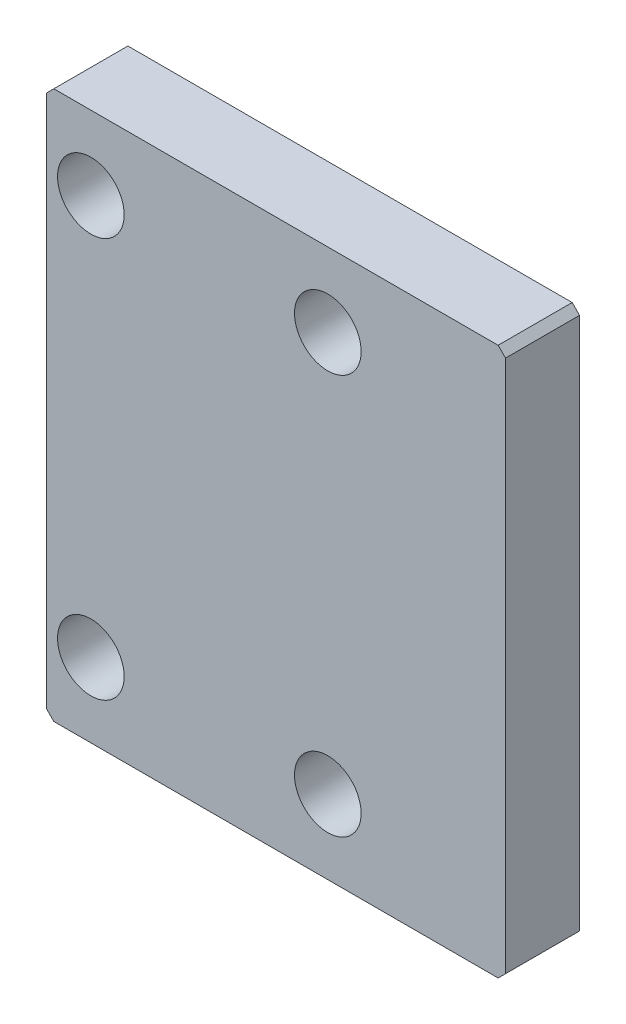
ISO-10303-21;
HEADER;
FILE_DESCRIPTION(('STEP AP214'),'2;1');
FILE_NAME('part.step','',(''),(''),'','','');
FILE_SCHEMA(('AUTOMOTIVE_DESIGN { 1 0 10303 214 1 1 1 1 }'));
ENDSEC;
DATA;
#1=APPLICATION_CONTEXT('core data for automotive mechanical design processes');
#2=APPLICATION_PROTOCOL_DEFINITION('international standard','automotive_design',2000,#1);
#3=PRODUCT_CONTEXT('',#1,'mechanical');
#4=PRODUCT('Part','Part','',(#3));
#5=PRODUCT_RELATED_PRODUCT_CATEGORY('part','',(#4));
#6=PRODUCT_DEFINITION_FORMATION('','',#4);
#7=PRODUCT_DEFINITION_CONTEXT('part definition',#1,'design');
#8=PRODUCT_DEFINITION('design','',#6,#7);
#9=PRODUCT_DEFINITION_SHAPE('','',#8);
#10=(LENGTH_UNIT() NAMED_UNIT(*) SI_UNIT(.MILLI.,.METRE.));
#11=(NAMED_UNIT(*) PLANE_ANGLE_UNIT() SI_UNIT($,.RADIAN.));
#12=(NAMED_UNIT(*) SI_UNIT($,.STERADIAN.) SOLID_ANGLE_UNIT());
#13=UNCERTAINTY_MEASURE_WITH_UNIT(LENGTH_MEASURE(1.E-05),#10,'distance_accuracy_value','');
#14=(GEOMETRIC_REPRESENTATION_CONTEXT(3) GLOBAL_UNCERTAINTY_ASSIGNED_CONTEXT((#13)) GLOBAL_UNIT_ASSIGNED_CONTEXT((#10,
#11,#12)) REPRESENTATION_CONTEXT('',''));
#15=CARTESIAN_POINT('',(0.,0.,0.));
#16=DIRECTION('',(0.,0.,1.));
#17=DIRECTION('',(1.,0.,0.));
#18=AXIS2_PLACEMENT_3D('',#15,#16,#17);
#19=CARTESIAN_POINT('',(-412.720096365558,-1.64,5.));
#20=DIRECTION('',(1.,0.,0.));
#21=DIRECTION('',(0.,0.,-1.));
#22=AXIS2_PLACEMENT_3D('',#19,#20,#21);
#23=PLANE('',#22);
#24=DIRECTION('',(0.,-1.,0.));
#25=VECTOR('',#24,1.);
#26=CARTESIAN_POINT('',(-412.720096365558,-1.64,5.));
#27=LINE('',#26,#25);
#28=CARTESIAN_POINT('',(-412.720096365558,34.86,5.));
#29=VERTEX_POINT('',#28);
#30=CARTESIAN_POINT('',(-412.720096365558,-1.13999999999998,5.));
#31=VERTEX_POINT('',#30);
#32=EDGE_CURVE('E101',#29,#31,#27,.T.);
#33=ORIENTED_EDGE('',*,*,#32,.F.);
#34=DIRECTION('',(0.,0.,-1.));
#35=VECTOR('',#34,1.);
#36=CARTESIAN_POINT('',(-412.720096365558,34.86,5.));
#37=LINE('',#36,#35);
#38=CARTESIAN_POINT('',(-412.720096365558,34.86,0.));
#39=VERTEX_POINT('',#38);
#40=EDGE_CURVE('E86',#29,#39,#37,.T.);
#41=ORIENTED_EDGE('',*,*,#40,.T.);
#42=DIRECTION('',(0.,-1.,0.));
#43=VECTOR('',#42,1.);
#44=CARTESIAN_POINT('',(-412.720096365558,-1.64,0.));
#45=LINE('',#44,#43);
#46=CARTESIAN_POINT('',(-412.720096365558,-1.13999999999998,0.));
#47=VERTEX_POINT('',#46);
#48=EDGE_CURVE('E98',#39,#47,#45,.T.);
#49=ORIENTED_EDGE('',*,*,#48,.T.);
#50=DIRECTION('',(0.,0.,1.));
#51=VECTOR('',#50,1.);
#52=CARTESIAN_POINT('',(-412.720096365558,-1.13999999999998,5.));
#53=LINE('',#52,#51);
#54=EDGE_CURVE('E103',#47,#31,#53,.T.);
#55=ORIENTED_EDGE('',*,*,#54,.T.);
#56=EDGE_LOOP('',(#33,#41,#49,#55));
#57=FACE_BOUND('',#56,.T.);
#58=ADVANCED_FACE('F16',(#57),#23,.F.);
#59=CARTESIAN_POINT('',(-412.720096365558,-1.64,5.));
#60=DIRECTION('',(0.,1.,0.));
#61=DIRECTION('',(0.,0.,1.));
#62=AXIS2_PLACEMENT_3D('',#59,#60,#61);
#63=PLANE('',#62);
#64=DIRECTION('',(1.,0.,0.));
#65=VECTOR('',#64,1.);
#66=CARTESIAN_POINT('',(-412.720096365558,-1.64,5.));
#67=LINE('',#66,#65);
#68=CARTESIAN_POINT('',(-412.220096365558,-1.64,5.));
#69=VERTEX_POINT('',#68);
#70=CARTESIAN_POINT('',(-382.220096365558,-1.64,5.));
#71=VERTEX_POINT('',#70);
#72=EDGE_CURVE('E147',#69,#71,#67,.T.);
#73=ORIENTED_EDGE('',*,*,#72,.F.);
#74=DIRECTION('',(0.,0.,-1.));
#75=VECTOR('',#74,1.);
#76=CARTESIAN_POINT('',(-412.220096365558,-1.64,5.));
#77=LINE('',#76,#75);
#78=CARTESIAN_POINT('',(-412.220096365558,-1.64,0.));
#79=VERTEX_POINT('',#78);
#80=EDGE_CURVE('E140',#69,#79,#77,.T.);
#81=ORIENTED_EDGE('',*,*,#80,.T.);
#82=DIRECTION('',(1.,0.,0.));
#83=VECTOR('',#82,1.);
#84=CARTESIAN_POINT('',(-412.720096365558,-1.64,0.));
#85=LINE('',#84,#83);
#86=CARTESIAN_POINT('',(-382.220096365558,-1.64,0.));
#87=VERTEX_POINT('',#86);
#88=EDGE_CURVE('E107',#79,#87,#85,.T.);
#89=ORIENTED_EDGE('',*,*,#88,.T.);
#90=DIRECTION('',(0.,0.,1.));
#91=VECTOR('',#90,1.);
#92=CARTESIAN_POINT('',(-382.220096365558,-1.64,5.));
#93=LINE('',#92,#91);
#94=EDGE_CURVE('E138',#87,#71,#93,.T.);
#95=ORIENTED_EDGE('',*,*,#94,.T.);
#96=EDGE_LOOP('',(#73,#81,#89,#95));
#97=FACE_BOUND('',#96,.T.);
#98=ADVANCED_FACE('F145',(#97),#63,.F.);
#99=CARTESIAN_POINT('',(-381.720096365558,-1.64,5.));
#100=DIRECTION('',(-1.,0.,0.));
#101=DIRECTION('',(0.,0.,1.));
#102=AXIS2_PLACEMENT_3D('',#99,#100,#101);
#103=PLANE('',#102);
#104=DIRECTION('',(0.,1.,0.));
#105=VECTOR('',#104,1.);
#106=CARTESIAN_POINT('',(-381.720096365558,-1.64,5.));
#107=LINE('',#106,#105);
#108=CARTESIAN_POINT('',(-381.720096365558,-1.14000000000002,5.));
#109=VERTEX_POINT('',#108);
#110=CARTESIAN_POINT('',(-381.720096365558,34.86,5.));
#111=VERTEX_POINT('',#110);
#112=EDGE_CURVE('E155',#109,#111,#107,.T.);
#113=ORIENTED_EDGE('',*,*,#112,.F.);
#114=DIRECTION('',(0.,0.,-1.));
#115=VECTOR('',#114,1.);
#116=CARTESIAN_POINT('',(-381.720096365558,-1.14000000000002,5.));
#117=LINE('',#116,#115);
#118=CARTESIAN_POINT('',(-381.720096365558,-1.14,0.));
#119=VERTEX_POINT('',#118);
#120=EDGE_CURVE('E11',#109,#119,#117,.T.);
#121=ORIENTED_EDGE('',*,*,#120,.T.);
#122=DIRECTION('',(0.,1.,0.));
#123=VECTOR('',#122,1.);
#124=CARTESIAN_POINT('',(-381.720096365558,-1.64,0.));
#125=LINE('',#124,#123);
#126=CARTESIAN_POINT('',(-381.720096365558,34.86,0.));
#127=VERTEX_POINT('',#126);
#128=EDGE_CURVE('E111',#119,#127,#125,.T.);
#129=ORIENTED_EDGE('',*,*,#128,.T.);
#130=DIRECTION('',(0.,0.,1.));
#131=VECTOR('',#130,1.);
#132=CARTESIAN_POINT('',(-381.720096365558,34.86,5.));
#133=LINE('',#132,#131);
#134=EDGE_CURVE('E24',#127,#111,#133,.T.);
#135=ORIENTED_EDGE('',*,*,#134,.T.);
#136=EDGE_LOOP('',(#113,#121,#129,#135));
#137=FACE_BOUND('',#136,.T.);
#138=ADVANCED_FACE('F154',(#137),#103,.F.);
#139=CARTESIAN_POINT('',(-412.720096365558,35.36,5.));
#140=DIRECTION('',(0.,-1.,0.));
#141=DIRECTION('',(0.,0.,-1.));
#142=AXIS2_PLACEMENT_3D('',#139,#140,#141);
#143=PLANE('',#142);
#144=DIRECTION('',(-1.,0.,0.));
#145=VECTOR('',#144,1.);
#146=CARTESIAN_POINT('',(-412.720096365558,35.36,0.));
#147=LINE('',#146,#145);
#148=CARTESIAN_POINT('',(-382.220096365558,35.36,0.));
#149=VERTEX_POINT('',#148);
#150=CARTESIAN_POINT('',(-412.220096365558,35.36,0.));
#151=VERTEX_POINT('',#150);
#152=EDGE_CURVE('E121',#149,#151,#147,.T.);
#153=ORIENTED_EDGE('',*,*,#152,.T.);
#154=DIRECTION('',(0.,0.,1.));
#155=VECTOR('',#154,1.);
#156=CARTESIAN_POINT('',(-412.220096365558,35.36,5.));
#157=LINE('',#156,#155);
#158=CARTESIAN_POINT('',(-412.220096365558,35.36,5.));
#159=VERTEX_POINT('',#158);
#160=EDGE_CURVE('E87',#151,#159,#157,.T.);
#161=ORIENTED_EDGE('',*,*,#160,.T.);
#162=DIRECTION('',(-1.,0.,0.));
#163=VECTOR('',#162,1.);
#164=CARTESIAN_POINT('',(-412.720096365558,35.36,5.));
#165=LINE('',#164,#163);
#166=CARTESIAN_POINT('',(-382.220096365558,35.36,5.));
#167=VERTEX_POINT('',#166);
#168=EDGE_CURVE('E117',#167,#159,#165,.T.);
#169=ORIENTED_EDGE('',*,*,#168,.F.);
#170=DIRECTION('',(0.,0.,-1.));
#171=VECTOR('',#170,1.);
#172=CARTESIAN_POINT('',(-382.220096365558,35.36,5.));
#173=LINE('',#172,#171);
#174=EDGE_CURVE('E92',#167,#149,#173,.T.);
#175=ORIENTED_EDGE('',*,*,#174,.T.);
#176=EDGE_LOOP('',(#153,#161,#169,#175));
#177=FACE_BOUND('',#176,.T.);
#178=ADVANCED_FACE('F187',(#177),#143,.F.);
#179=CARTESIAN_POINT('',(0.,0.,5.));
#180=DIRECTION('',(0.,0.,-1.));
#181=DIRECTION('',(-1.,0.,0.));
#182=AXIS2_PLACEMENT_3D('',#179,#180,#181);
#183=PLANE('',#182);
#184=CARTESIAN_POINT('',(-393.720096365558,3.36,5.));
#185=DIRECTION('',(0.,0.,1.));
#186=DIRECTION('',(1.,0.,0.));
#187=AXIS2_PLACEMENT_3D('',#184,#185,#186);
#188=CIRCLE('',#187,2.24999999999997);
#189=CARTESIAN_POINT('',(-391.470096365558,3.36,5.));
#190=VERTEX_POINT('',#189);
#191=EDGE_CURVE('E178',#190,#190,#188,.T.);
#192=ORIENTED_EDGE('',*,*,#191,.F.);
#193=EDGE_LOOP('',(#192));
#194=FACE_BOUND('',#193,.T.);
#195=CARTESIAN_POINT('',(-393.720096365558,30.36,5.));
#196=DIRECTION('',(0.,0.,1.));
#197=DIRECTION('',(1.,0.,0.));
#198=AXIS2_PLACEMENT_3D('',#195,#196,#197);
#199=CIRCLE('',#198,2.24999999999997);
#200=CARTESIAN_POINT('',(-391.470096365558,30.36,5.));
#201=VERTEX_POINT('',#200);
#202=EDGE_CURVE('E172',#201,#201,#199,.T.);
#203=ORIENTED_EDGE('',*,*,#202,.F.);
#204=EDGE_LOOP('',(#203));
#205=FACE_BOUND('',#204,.T.);
#206=CARTESIAN_POINT('',(-409.720096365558,30.36,5.));
#207=DIRECTION('',(0.,0.,1.));
#208=DIRECTION('',(1.,0.,0.));
#209=AXIS2_PLACEMENT_3D('',#206,#207,#208);
#210=CIRCLE('',#209,2.24999999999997);
#211=CARTESIAN_POINT('',(-407.470096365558,30.36,5.));
#212=VERTEX_POINT('',#211);
#213=EDGE_CURVE('E166',#212,#212,#210,.T.);
#214=ORIENTED_EDGE('',*,*,#213,.F.);
#215=EDGE_LOOP('',(#214));
#216=FACE_BOUND('',#215,.T.);
#217=CARTESIAN_POINT('',(-409.720096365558,3.36,5.));
#218=DIRECTION('',(0.,0.,1.));
#219=DIRECTION('',(1.,0.,0.));
#220=AXIS2_PLACEMENT_3D('',#217,#218,#219);
#221=CIRCLE('',#220,2.24999999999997);
#222=CARTESIAN_POINT('',(-407.470096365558,3.36,5.));
#223=VERTEX_POINT('',#222);
#224=EDGE_CURVE('E114',#223,#223,#221,.T.);
#225=ORIENTED_EDGE('',*,*,#224,.F.);
#226=EDGE_LOOP('',(#225));
#227=FACE_BOUND('',#226,.T.);
#228=ORIENTED_EDGE('',*,*,#168,.T.);
#229=DIRECTION('',(0.707106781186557,0.707106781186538,0.));
#230=VECTOR('',#229,1.);
#231=CARTESIAN_POINT('',(-412.720096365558,34.86,5.));
#232=LINE('',#231,#230);
#233=EDGE_CURVE('E136',#159,#29,#232,.F.);
#234=ORIENTED_EDGE('',*,*,#233,.T.);
#235=ORIENTED_EDGE('',*,*,#32,.T.);
#236=DIRECTION('',(-0.707106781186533,0.707106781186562,0.));
#237=VECTOR('',#236,1.);
#238=CARTESIAN_POINT('',(-412.220096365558,-1.64,5.));
#239=LINE('',#238,#237);
#240=EDGE_CURVE('E134',#31,#69,#239,.F.);
#241=ORIENTED_EDGE('',*,*,#240,.T.);
#242=ORIENTED_EDGE('',*,*,#72,.T.);
#243=DIRECTION('',(-0.707106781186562,-0.707106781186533,0.));
#244=VECTOR('',#243,1.);
#245=CARTESIAN_POINT('',(-381.720096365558,-1.14000000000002,5.));
#246=LINE('',#245,#244);
#247=EDGE_CURVE('E37',#71,#109,#246,.F.);
#248=ORIENTED_EDGE('',*,*,#247,.T.);
#249=ORIENTED_EDGE('',*,*,#112,.T.);
#250=DIRECTION('',(0.707106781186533,-0.707106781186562,0.));
#251=VECTOR('',#250,1.);
#252=CARTESIAN_POINT('',(-382.220096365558,35.36,5.));
#253=LINE('',#252,#251);
#254=EDGE_CURVE('E131',#111,#167,#253,.F.);
#255=ORIENTED_EDGE('',*,*,#254,.T.);
#256=EDGE_LOOP('',(#228,#234,#235,#241,#242,#248,#249,#255));
#257=FACE_BOUND('',#256,.T.);
#258=ADVANCED_FACE('F184',(#194,#205,#216,#227,#257),#183,.F.);
#259=CARTESIAN_POINT('',(0.,0.,0.));
#260=DIRECTION('',(0.,0.,-1.));
#261=DIRECTION('',(-1.,0.,0.));
#262=AXIS2_PLACEMENT_3D('',#259,#260,#261);
#263=PLANE('',#262);
#264=CARTESIAN_POINT('',(-393.720096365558,3.36,0.));
#265=DIRECTION('',(0.,0.,1.));
#266=DIRECTION('',(1.,0.,0.));
#267=AXIS2_PLACEMENT_3D('',#264,#265,#266);
#268=CIRCLE('',#267,2.24999999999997);
#269=CARTESIAN_POINT('',(-391.470096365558,3.36,0.));
#270=VERTEX_POINT('',#269);
#271=EDGE_CURVE('E175',#270,#270,#268,.T.);
#272=ORIENTED_EDGE('',*,*,#271,.T.);
#273=EDGE_LOOP('',(#272));
#274=FACE_BOUND('',#273,.T.);
#275=CARTESIAN_POINT('',(-393.720096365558,30.36,0.));
#276=DIRECTION('',(0.,0.,1.));
#277=DIRECTION('',(1.,0.,0.));
#278=AXIS2_PLACEMENT_3D('',#275,#276,#277);
#279=CIRCLE('',#278,2.24999999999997);
#280=CARTESIAN_POINT('',(-391.470096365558,30.36,0.));
#281=VERTEX_POINT('',#280);
#282=EDGE_CURVE('E169',#281,#281,#279,.T.);
#283=ORIENTED_EDGE('',*,*,#282,.T.);
#284=EDGE_LOOP('',(#283));
#285=FACE_BOUND('',#284,.T.);
#286=CARTESIAN_POINT('',(-409.720096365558,30.36,0.));
#287=DIRECTION('',(0.,0.,1.));
#288=DIRECTION('',(1.,0.,0.));
#289=AXIS2_PLACEMENT_3D('',#286,#287,#288);
#290=CIRCLE('',#289,2.24999999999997);
#291=CARTESIAN_POINT('',(-407.470096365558,30.36,0.));
#292=VERTEX_POINT('',#291);
#293=EDGE_CURVE('E163',#292,#292,#290,.T.);
#294=ORIENTED_EDGE('',*,*,#293,.T.);
#295=EDGE_LOOP('',(#294));
#296=FACE_BOUND('',#295,.T.);
#297=CARTESIAN_POINT('',(-409.720096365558,3.36,0.));
#298=DIRECTION('',(0.,0.,1.));
#299=DIRECTION('',(1.,0.,0.));
#300=AXIS2_PLACEMENT_3D('',#297,#298,#299);
#301=CIRCLE('',#300,2.24999999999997);
#302=CARTESIAN_POINT('',(-407.470096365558,3.36,0.));
#303=VERTEX_POINT('',#302);
#304=EDGE_CURVE('E108',#303,#303,#301,.T.);
#305=ORIENTED_EDGE('',*,*,#304,.T.);
#306=EDGE_LOOP('',(#305));
#307=FACE_BOUND('',#306,.T.);
#308=ORIENTED_EDGE('',*,*,#48,.F.);
#309=DIRECTION('',(-0.707106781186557,-0.707106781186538,0.));
#310=VECTOR('',#309,1.);
#311=CARTESIAN_POINT('',(-223.790048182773,223.79004818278,0.));
#312=LINE('',#311,#310);
#313=EDGE_CURVE('E82',#39,#151,#312,.F.);
#314=ORIENTED_EDGE('',*,*,#313,.T.);
#315=ORIENTED_EDGE('',*,*,#152,.F.);
#316=DIRECTION('',(-0.707106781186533,0.707106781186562,0.));
#317=VECTOR('',#316,1.);
#318=CARTESIAN_POINT('',(-173.430048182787,-173.43004818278,0.));
#319=LINE('',#318,#317);
#320=EDGE_CURVE('E102',#149,#127,#319,.F.);
#321=ORIENTED_EDGE('',*,*,#320,.T.);
#322=ORIENTED_EDGE('',*,*,#128,.F.);
#323=DIRECTION('',(0.707106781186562,0.707106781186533,0.));
#324=VECTOR('',#323,1.);
#325=CARTESIAN_POINT('',(-190.290048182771,190.290048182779,0.));
#326=LINE('',#325,#324);
#327=EDGE_CURVE('E125',#119,#87,#326,.F.);
#328=ORIENTED_EDGE('',*,*,#327,.T.);
#329=ORIENTED_EDGE('',*,*,#88,.F.);
#330=DIRECTION('',(0.707106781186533,-0.707106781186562,0.));
#331=VECTOR('',#330,1.);
#332=CARTESIAN_POINT('',(-206.930048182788,-206.930048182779,0.));
#333=LINE('',#332,#331);
#334=EDGE_CURVE('E93',#79,#47,#333,.F.);
#335=ORIENTED_EDGE('',*,*,#334,.T.);
#336=EDGE_LOOP('',(#308,#314,#315,#321,#322,#328,#329,#335));
#337=FACE_BOUND('',#336,.T.);
#338=ADVANCED_FACE('F105',(#274,#285,#296,#307,#337),#263,.T.);
#339=CARTESIAN_POINT('',(-409.720096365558,3.36,5.));
#340=DIRECTION('',(0.,0.,1.));
#341=DIRECTION('',(1.,0.,0.));
#342=AXIS2_PLACEMENT_3D('',#339,#340,#341);
#343=CYLINDRICAL_SURFACE('',#342,2.24999999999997);
#344=ORIENTED_EDGE('',*,*,#304,.F.);
#345=EDGE_LOOP('',(#344));
#346=FACE_BOUND('',#345,.T.);
#347=ORIENTED_EDGE('',*,*,#224,.T.);
#348=EDGE_LOOP('',(#347));
#349=FACE_BOUND('',#348,.T.);
#350=ADVANCED_FACE('F263',(#346,#349),#343,.F.);
#351=CARTESIAN_POINT('',(-409.720096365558,30.36,5.));
#352=DIRECTION('',(0.,0.,1.));
#353=DIRECTION('',(1.,0.,0.));
#354=AXIS2_PLACEMENT_3D('',#351,#352,#353);
#355=CYLINDRICAL_SURFACE('',#354,2.24999999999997);
#356=ORIENTED_EDGE('',*,*,#293,.F.);
#357=EDGE_LOOP('',(#356));
#358=FACE_BOUND('',#357,.T.);
#359=ORIENTED_EDGE('',*,*,#213,.T.);
#360=EDGE_LOOP('',(#359));
#361=FACE_BOUND('',#360,.T.);
#362=ADVANCED_FACE('F255',(#358,#361),#355,.F.);
#363=CARTESIAN_POINT('',(-393.720096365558,30.36,5.));
#364=DIRECTION('',(0.,0.,1.));
#365=DIRECTION('',(1.,0.,0.));
#366=AXIS2_PLACEMENT_3D('',#363,#364,#365);
#367=CYLINDRICAL_SURFACE('',#366,2.24999999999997);
#368=ORIENTED_EDGE('',*,*,#282,.F.);
#369=EDGE_LOOP('',(#368));
#370=FACE_BOUND('',#369,.T.);
#371=ORIENTED_EDGE('',*,*,#202,.T.);
#372=EDGE_LOOP('',(#371));
#373=FACE_BOUND('',#372,.T.);
#374=ADVANCED_FACE('F247',(#370,#373),#367,.F.);
#375=CARTESIAN_POINT('',(-393.720096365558,3.36,5.));
#376=DIRECTION('',(0.,0.,1.));
#377=DIRECTION('',(1.,0.,0.));
#378=AXIS2_PLACEMENT_3D('',#375,#376,#377);
#379=CYLINDRICAL_SURFACE('',#378,2.24999999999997);
#380=ORIENTED_EDGE('',*,*,#271,.F.);
#381=EDGE_LOOP('',(#380));
#382=FACE_BOUND('',#381,.T.);
#383=ORIENTED_EDGE('',*,*,#191,.T.);
#384=EDGE_LOOP('',(#383));
#385=FACE_BOUND('',#384,.T.);
#386=ADVANCED_FACE('F182',(#382,#385),#379,.F.);
#387=CARTESIAN_POINT('',(-412.720096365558,34.86,5.));
#388=DIRECTION('',(0.707106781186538,-0.707106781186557,0.));
#389=DIRECTION('',(0.,0.,-1.));
#390=AXIS2_PLACEMENT_3D('',#387,#388,#389);
#391=PLANE('',#390);
#392=ORIENTED_EDGE('',*,*,#233,.F.);
#393=ORIENTED_EDGE('',*,*,#160,.F.);
#394=ORIENTED_EDGE('',*,*,#313,.F.);
#395=ORIENTED_EDGE('',*,*,#40,.F.);
#396=EDGE_LOOP('',(#392,#393,#394,#395));
#397=FACE_BOUND('',#396,.T.);
#398=ADVANCED_FACE('F85',(#397),#391,.F.);
#399=CARTESIAN_POINT('',(-412.220096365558,-1.64,5.));
#400=DIRECTION('',(0.707106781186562,0.707106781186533,0.));
#401=DIRECTION('',(0.,0.,-1.));
#402=AXIS2_PLACEMENT_3D('',#399,#400,#401);
#403=PLANE('',#402);
#404=ORIENTED_EDGE('',*,*,#240,.F.);
#405=ORIENTED_EDGE('',*,*,#54,.F.);
#406=ORIENTED_EDGE('',*,*,#334,.F.);
#407=ORIENTED_EDGE('',*,*,#80,.F.);
#408=EDGE_LOOP('',(#404,#405,#406,#407));
#409=FACE_BOUND('',#408,.T.);
#410=ADVANCED_FACE('F204',(#409),#403,.F.);
#411=CARTESIAN_POINT('',(-381.720096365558,-1.14000000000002,5.));
#412=DIRECTION('',(-0.707106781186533,0.707106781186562,0.));
#413=DIRECTION('',(0.,0.,-1.));
#414=AXIS2_PLACEMENT_3D('',#411,#412,#413);
#415=PLANE('',#414);
#416=ORIENTED_EDGE('',*,*,#247,.F.);
#417=ORIENTED_EDGE('',*,*,#94,.F.);
#418=ORIENTED_EDGE('',*,*,#327,.F.);
#419=ORIENTED_EDGE('',*,*,#120,.F.);
#420=EDGE_LOOP('',(#416,#417,#418,#419));
#421=FACE_BOUND('',#420,.T.);
#422=ADVANCED_FACE('F153',(#421),#415,.F.);
#423=CARTESIAN_POINT('',(-382.220096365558,35.36,5.));
#424=DIRECTION('',(-0.707106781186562,-0.707106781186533,0.));
#425=DIRECTION('',(0.,0.,-1.));
#426=AXIS2_PLACEMENT_3D('',#423,#424,#425);
#427=PLANE('',#426);
#428=ORIENTED_EDGE('',*,*,#254,.F.);
#429=ORIENTED_EDGE('',*,*,#134,.F.);
#430=ORIENTED_EDGE('',*,*,#320,.F.);
#431=ORIENTED_EDGE('',*,*,#174,.F.);
#432=EDGE_LOOP('',(#428,#429,#430,#431));
#433=FACE_BOUND('',#432,.T.);
#434=ADVANCED_FACE('F18',(#433),#427,.F.);
#435=CLOSED_SHELL('',(#58,#98,#138,#178,#258,#338,#350,#362,#374,#386,#398,#410,#422,#434));
#436=MANIFOLD_SOLID_BREP('B1',#435);
#437=ADVANCED_BREP_SHAPE_REPRESENTATION('',(#18,#436),#14);
#438=SHAPE_DEFINITION_REPRESENTATION(#9,#437);
ENDSEC;
END-ISO-10303-21;
